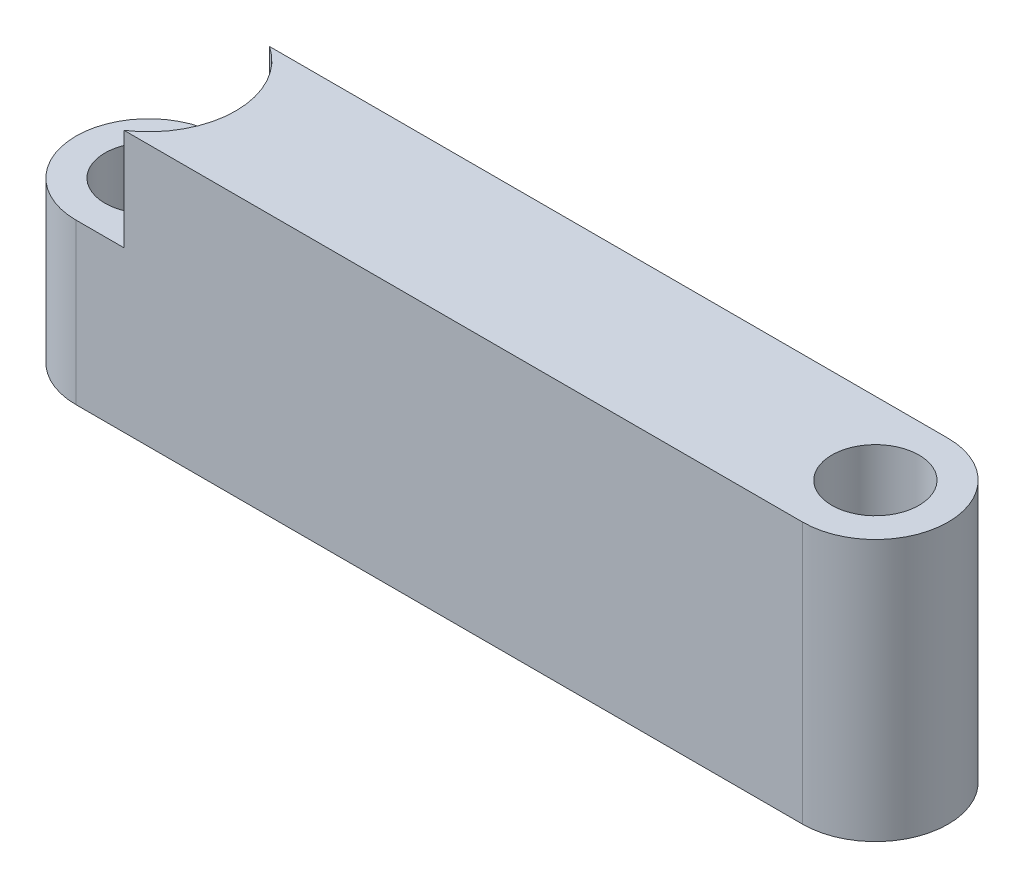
ISO-10303-21;
HEADER;
FILE_DESCRIPTION(('STEP AP214'),'2;1');
FILE_NAME('part.step','',(''),(''),'','','');
FILE_SCHEMA(('AUTOMOTIVE_DESIGN { 1 0 10303 214 1 1 1 1 }'));
ENDSEC;
DATA;
#1=APPLICATION_CONTEXT('core data for automotive mechanical design processes');
#2=APPLICATION_PROTOCOL_DEFINITION('international standard','automotive_design',2000,#1);
#3=PRODUCT_CONTEXT('',#1,'mechanical');
#4=PRODUCT('Part','Part','',(#3));
#5=PRODUCT_RELATED_PRODUCT_CATEGORY('part','',(#4));
#6=PRODUCT_DEFINITION_FORMATION('','',#4);
#7=PRODUCT_DEFINITION_CONTEXT('part definition',#1,'design');
#8=PRODUCT_DEFINITION('design','',#6,#7);
#9=PRODUCT_DEFINITION_SHAPE('','',#8);
#10=(LENGTH_UNIT() NAMED_UNIT(*) SI_UNIT(.MILLI.,.METRE.));
#11=(NAMED_UNIT(*) PLANE_ANGLE_UNIT() SI_UNIT($,.RADIAN.));
#12=(NAMED_UNIT(*) SI_UNIT($,.STERADIAN.) SOLID_ANGLE_UNIT());
#13=UNCERTAINTY_MEASURE_WITH_UNIT(LENGTH_MEASURE(1.E-05),#10,'distance_accuracy_value','');
#14=(GEOMETRIC_REPRESENTATION_CONTEXT(3) GLOBAL_UNCERTAINTY_ASSIGNED_CONTEXT((#13)) GLOBAL_UNIT_ASSIGNED_CONTEXT((#10,
#11,#12)) REPRESENTATION_CONTEXT('',''));
#15=CARTESIAN_POINT('',(0.,0.,0.));
#16=DIRECTION('',(0.,0.,1.));
#17=DIRECTION('',(1.,0.,0.));
#18=AXIS2_PLACEMENT_3D('',#15,#16,#17);
#19=CARTESIAN_POINT('',(-10.9827898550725,9.,0.));
#20=DIRECTION('',(0.,-1.,0.));
#21=DIRECTION('',(0.,0.,-1.));
#22=AXIS2_PLACEMENT_3D('',#19,#20,#21);
#23=CYLINDRICAL_SURFACE('',#22,2.5);
#24=CARTESIAN_POINT('',(-10.9827898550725,5.5,0.));
#25=DIRECTION('',(0.,1.,0.));
#26=DIRECTION('',(0.,0.,1.));
#27=AXIS2_PLACEMENT_3D('',#24,#25,#26);
#28=CIRCLE('',#27,2.5);
#29=CARTESIAN_POINT('',(-10.9827898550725,5.5,-2.5));
#30=VERTEX_POINT('',#29);
#31=CARTESIAN_POINT('',(-10.9827898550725,5.5,2.5));
#32=VERTEX_POINT('',#31);
#33=EDGE_CURVE('E85',#30,#32,#28,.T.);
#34=ORIENTED_EDGE('',*,*,#33,.F.);
#35=DIRECTION('',(0.,-1.,0.));
#36=VECTOR('',#35,1.);
#37=CARTESIAN_POINT('',(-10.9827898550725,9.,-2.5));
#38=LINE('',#37,#36);
#39=CARTESIAN_POINT('',(-10.9827898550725,0.,-2.5));
#40=VERTEX_POINT('',#39);
#41=EDGE_CURVE('E79',#30,#40,#38,.T.);
#42=ORIENTED_EDGE('',*,*,#41,.T.);
#43=CARTESIAN_POINT('',(-10.9827898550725,0.,0.));
#44=DIRECTION('',(0.,1.,0.));
#45=DIRECTION('',(0.,0.,1.));
#46=AXIS2_PLACEMENT_3D('',#43,#44,#45);
#47=CIRCLE('',#46,2.5);
#48=CARTESIAN_POINT('',(-10.9827898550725,0.,2.5));
#49=VERTEX_POINT('',#48);
#50=EDGE_CURVE('E82',#40,#49,#47,.T.);
#51=ORIENTED_EDGE('',*,*,#50,.T.);
#52=DIRECTION('',(0.,-1.,0.));
#53=VECTOR('',#52,1.);
#54=CARTESIAN_POINT('',(-10.9827898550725,9.,2.5));
#55=LINE('',#54,#53);
#56=EDGE_CURVE('E11',#32,#49,#55,.T.);
#57=ORIENTED_EDGE('',*,*,#56,.F.);
#58=EDGE_LOOP('',(#34,#42,#51,#57));
#59=FACE_BOUND('',#58,.T.);
#60=ADVANCED_FACE('F35',(#59),#23,.T.);
#61=CARTESIAN_POINT('',(-10.9827898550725,9.,0.));
#62=DIRECTION('',(0.,-1.,0.));
#63=DIRECTION('',(0.,0.,-1.));
#64=AXIS2_PLACEMENT_3D('',#61,#62,#63);
#65=CYLINDRICAL_SURFACE('',#64,1.5);
#66=CARTESIAN_POINT('',(-10.9827898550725,0.,0.));
#67=DIRECTION('',(0.,1.,0.));
#68=DIRECTION('',(0.,0.,1.));
#69=AXIS2_PLACEMENT_3D('',#66,#67,#68);
#70=CIRCLE('',#69,1.5);
#71=CARTESIAN_POINT('',(-10.9827898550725,0.,1.5));
#72=VERTEX_POINT('',#71);
#73=EDGE_CURVE('E99',#72,#72,#70,.T.);
#74=ORIENTED_EDGE('',*,*,#73,.F.);
#75=EDGE_LOOP('',(#74));
#76=FACE_BOUND('',#75,.T.);
#77=CARTESIAN_POINT('',(-10.9827898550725,5.5,0.));
#78=DIRECTION('',(0.,1.,0.));
#79=DIRECTION('',(0.,0.,1.));
#80=AXIS2_PLACEMENT_3D('',#77,#78,#79);
#81=CIRCLE('',#80,1.5);
#82=CARTESIAN_POINT('',(-10.9827898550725,5.5,1.5));
#83=VERTEX_POINT('',#82);
#84=EDGE_CURVE('E39',#83,#83,#81,.T.);
#85=ORIENTED_EDGE('',*,*,#84,.T.);
#86=EDGE_LOOP('',(#85));
#87=FACE_BOUND('',#86,.T.);
#88=ADVANCED_FACE('F37',(#76,#87),#65,.F.);
#89=CARTESIAN_POINT('',(0.,9.,2.5));
#90=DIRECTION('',(0.,0.,-1.));
#91=DIRECTION('',(-1.,0.,0.));
#92=AXIS2_PLACEMENT_3D('',#89,#90,#91);
#93=PLANE('',#92);
#94=DIRECTION('',(1.,0.,0.));
#95=VECTOR('',#94,1.);
#96=CARTESIAN_POINT('',(0.,9.,2.5));
#97=LINE('',#96,#95);
#98=CARTESIAN_POINT('',(-9.32447745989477,9.,2.5));
#99=VERTEX_POINT('',#98);
#100=CARTESIAN_POINT('',(14.0172101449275,9.,2.5));
#101=VERTEX_POINT('',#100);
#102=EDGE_CURVE('E108',#99,#101,#97,.T.);
#103=ORIENTED_EDGE('',*,*,#102,.F.);
#104=DIRECTION('',(0.,1.,0.));
#105=VECTOR('',#104,1.);
#106=CARTESIAN_POINT('',(-9.32447745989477,5.5,2.5));
#107=LINE('',#106,#105);
#108=CARTESIAN_POINT('',(-9.32447745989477,5.5,2.5));
#109=VERTEX_POINT('',#108);
#110=EDGE_CURVE('E51',#99,#109,#107,.F.);
#111=ORIENTED_EDGE('',*,*,#110,.T.);
#112=DIRECTION('',(1.,0.,0.));
#113=VECTOR('',#112,1.);
#114=CARTESIAN_POINT('',(0.,5.5,2.5));
#115=LINE('',#114,#113);
#116=EDGE_CURVE('E127',#32,#109,#115,.T.);
#117=ORIENTED_EDGE('',*,*,#116,.F.);
#118=ORIENTED_EDGE('',*,*,#56,.T.);
#119=DIRECTION('',(1.,0.,0.));
#120=VECTOR('',#119,1.);
#121=CARTESIAN_POINT('',(0.,0.,2.5));
#122=LINE('',#121,#120);
#123=CARTESIAN_POINT('',(14.0172101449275,0.,2.5));
#124=VERTEX_POINT('',#123);
#125=EDGE_CURVE('E98',#49,#124,#122,.T.);
#126=ORIENTED_EDGE('',*,*,#125,.T.);
#127=DIRECTION('',(0.,-1.,0.));
#128=VECTOR('',#127,1.);
#129=CARTESIAN_POINT('',(14.0172101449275,9.,2.5));
#130=LINE('',#129,#128);
#131=EDGE_CURVE('E44',#101,#124,#130,.T.);
#132=ORIENTED_EDGE('',*,*,#131,.F.);
#133=EDGE_LOOP('',(#103,#111,#117,#118,#126,#132));
#134=FACE_BOUND('',#133,.T.);
#135=ADVANCED_FACE('F122',(#134),#93,.F.);
#136=CARTESIAN_POINT('',(14.0172101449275,9.,0.));
#137=DIRECTION('',(0.,-1.,0.));
#138=DIRECTION('',(0.,0.,-1.));
#139=AXIS2_PLACEMENT_3D('',#136,#137,#138);
#140=CYLINDRICAL_SURFACE('',#139,2.5);
#141=CARTESIAN_POINT('',(14.0172101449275,0.,0.));
#142=DIRECTION('',(0.,1.,0.));
#143=DIRECTION('',(0.,0.,1.));
#144=AXIS2_PLACEMENT_3D('',#141,#142,#143);
#145=CIRCLE('',#144,2.5);
#146=CARTESIAN_POINT('',(14.0172101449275,0.,-2.5));
#147=VERTEX_POINT('',#146);
#148=EDGE_CURVE('E105',#124,#147,#145,.T.);
#149=ORIENTED_EDGE('',*,*,#148,.T.);
#150=DIRECTION('',(0.,-1.,0.));
#151=VECTOR('',#150,1.);
#152=CARTESIAN_POINT('',(14.0172101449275,9.,-2.5));
#153=LINE('',#152,#151);
#154=CARTESIAN_POINT('',(14.0172101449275,9.,-2.5));
#155=VERTEX_POINT('',#154);
#156=EDGE_CURVE('E88',#155,#147,#153,.T.);
#157=ORIENTED_EDGE('',*,*,#156,.F.);
#158=CARTESIAN_POINT('',(14.0172101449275,9.,0.));
#159=DIRECTION('',(0.,1.,0.));
#160=DIRECTION('',(0.,0.,1.));
#161=AXIS2_PLACEMENT_3D('',#158,#159,#160);
#162=CIRCLE('',#161,2.5);
#163=EDGE_CURVE('E119',#101,#155,#162,.T.);
#164=ORIENTED_EDGE('',*,*,#163,.F.);
#165=ORIENTED_EDGE('',*,*,#131,.T.);
#166=EDGE_LOOP('',(#149,#157,#164,#165));
#167=FACE_BOUND('',#166,.T.);
#168=ADVANCED_FACE('F118',(#167),#140,.T.);
#169=CARTESIAN_POINT('',(0.,9.,-2.5));
#170=DIRECTION('',(0.,0.,-1.));
#171=DIRECTION('',(-1.,0.,0.));
#172=AXIS2_PLACEMENT_3D('',#169,#170,#171);
#173=PLANE('',#172);
#174=DIRECTION('',(0.,1.,0.));
#175=VECTOR('',#174,1.);
#176=CARTESIAN_POINT('',(-9.32447745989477,5.5,-2.5));
#177=LINE('',#176,#175);
#178=CARTESIAN_POINT('',(-9.32447745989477,9.,-2.5));
#179=VERTEX_POINT('',#178);
#180=CARTESIAN_POINT('',(-9.32447745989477,5.5,-2.5));
#181=VERTEX_POINT('',#180);
#182=EDGE_CURVE('E139',#179,#181,#177,.F.);
#183=ORIENTED_EDGE('',*,*,#182,.F.);
#184=DIRECTION('',(1.,0.,0.));
#185=VECTOR('',#184,1.);
#186=CARTESIAN_POINT('',(0.,9.,-2.5));
#187=LINE('',#186,#185);
#188=EDGE_CURVE('E60',#179,#155,#187,.T.);
#189=ORIENTED_EDGE('',*,*,#188,.T.);
#190=ORIENTED_EDGE('',*,*,#156,.T.);
#191=DIRECTION('',(1.,0.,0.));
#192=VECTOR('',#191,1.);
#193=CARTESIAN_POINT('',(0.,0.,-2.5));
#194=LINE('',#193,#192);
#195=EDGE_CURVE('E97',#40,#147,#194,.T.);
#196=ORIENTED_EDGE('',*,*,#195,.F.);
#197=ORIENTED_EDGE('',*,*,#41,.F.);
#198=DIRECTION('',(1.,0.,0.));
#199=VECTOR('',#198,1.);
#200=CARTESIAN_POINT('',(0.,5.5,-2.5));
#201=LINE('',#200,#199);
#202=EDGE_CURVE('E136',#30,#181,#201,.T.);
#203=ORIENTED_EDGE('',*,*,#202,.T.);
#204=EDGE_LOOP('',(#183,#189,#190,#196,#197,#203));
#205=FACE_BOUND('',#204,.T.);
#206=ADVANCED_FACE('F101',(#205),#173,.T.);
#207=CARTESIAN_POINT('',(14.0172101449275,9.,0.));
#208=DIRECTION('',(0.,-1.,0.));
#209=DIRECTION('',(0.,0.,-1.));
#210=AXIS2_PLACEMENT_3D('',#207,#208,#209);
#211=CYLINDRICAL_SURFACE('',#210,1.5);
#212=CARTESIAN_POINT('',(14.0172101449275,9.,0.));
#213=DIRECTION('',(0.,1.,0.));
#214=DIRECTION('',(0.,0.,1.));
#215=AXIS2_PLACEMENT_3D('',#212,#213,#214);
#216=CIRCLE('',#215,1.5);
#217=CARTESIAN_POINT('',(14.0172101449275,9.,1.5));
#218=VERTEX_POINT('',#217);
#219=EDGE_CURVE('E89',#218,#218,#216,.T.);
#220=ORIENTED_EDGE('',*,*,#219,.T.);
#221=EDGE_LOOP('',(#220));
#222=FACE_BOUND('',#221,.T.);
#223=CARTESIAN_POINT('',(14.0172101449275,0.,0.));
#224=DIRECTION('',(0.,1.,0.));
#225=DIRECTION('',(0.,0.,1.));
#226=AXIS2_PLACEMENT_3D('',#223,#224,#225);
#227=CIRCLE('',#226,1.5);
#228=CARTESIAN_POINT('',(14.0172101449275,0.,1.5));
#229=VERTEX_POINT('',#228);
#230=EDGE_CURVE('E104',#229,#229,#227,.T.);
#231=ORIENTED_EDGE('',*,*,#230,.F.);
#232=EDGE_LOOP('',(#231));
#233=FACE_BOUND('',#232,.T.);
#234=ADVANCED_FACE('F178',(#222,#233),#211,.F.);
#235=CARTESIAN_POINT('',(0.,9.,0.));
#236=DIRECTION('',(0.,1.,0.));
#237=DIRECTION('',(0.,0.,1.));
#238=AXIS2_PLACEMENT_3D('',#235,#236,#237);
#239=PLANE('',#238);
#240=CARTESIAN_POINT('',(-10.9827898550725,9.,0.));
#241=DIRECTION('',(0.,1.,0.));
#242=DIRECTION('',(0.,0.,1.));
#243=AXIS2_PLACEMENT_3D('',#240,#241,#242);
#244=CIRCLE('',#243,3.);
#245=EDGE_CURVE('E143',#99,#179,#244,.T.);
#246=ORIENTED_EDGE('',*,*,#245,.F.);
#247=ORIENTED_EDGE('',*,*,#102,.T.);
#248=ORIENTED_EDGE('',*,*,#163,.T.);
#249=ORIENTED_EDGE('',*,*,#188,.F.);
#250=EDGE_LOOP('',(#246,#247,#248,#249));
#251=FACE_BOUND('',#250,.T.);
#252=ORIENTED_EDGE('',*,*,#219,.F.);
#253=EDGE_LOOP('',(#252));
#254=FACE_BOUND('',#253,.T.);
#255=ADVANCED_FACE('F155',(#251,#254),#239,.T.);
#256=CARTESIAN_POINT('',(0.,0.,0.));
#257=DIRECTION('',(0.,1.,0.));
#258=DIRECTION('',(0.,0.,1.));
#259=AXIS2_PLACEMENT_3D('',#256,#257,#258);
#260=PLANE('',#259);
#261=ORIENTED_EDGE('',*,*,#73,.T.);
#262=EDGE_LOOP('',(#261));
#263=FACE_BOUND('',#262,.T.);
#264=ORIENTED_EDGE('',*,*,#50,.F.);
#265=ORIENTED_EDGE('',*,*,#195,.T.);
#266=ORIENTED_EDGE('',*,*,#148,.F.);
#267=ORIENTED_EDGE('',*,*,#125,.F.);
#268=EDGE_LOOP('',(#264,#265,#266,#267));
#269=FACE_BOUND('',#268,.T.);
#270=ORIENTED_EDGE('',*,*,#230,.T.);
#271=EDGE_LOOP('',(#270));
#272=FACE_BOUND('',#271,.T.);
#273=ADVANCED_FACE('F94',(#263,#269,#272),#260,.F.);
#274=CARTESIAN_POINT('',(-10.9827898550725,5.5,0.));
#275=DIRECTION('',(0.,1.,0.));
#276=DIRECTION('',(0.,0.,1.));
#277=AXIS2_PLACEMENT_3D('',#274,#275,#276);
#278=PLANE('',#277);
#279=ORIENTED_EDGE('',*,*,#84,.F.);
#280=EDGE_LOOP('',(#279));
#281=FACE_BOUND('',#280,.T.);
#282=ORIENTED_EDGE('',*,*,#116,.T.);
#283=CARTESIAN_POINT('',(-10.9827898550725,5.5,0.));
#284=DIRECTION('',(0.,1.,0.));
#285=DIRECTION('',(0.,0.,1.));
#286=AXIS2_PLACEMENT_3D('',#283,#284,#285);
#287=CIRCLE('',#286,3.);
#288=EDGE_CURVE('E142',#109,#181,#287,.T.);
#289=ORIENTED_EDGE('',*,*,#288,.T.);
#290=ORIENTED_EDGE('',*,*,#202,.F.);
#291=ORIENTED_EDGE('',*,*,#33,.T.);
#292=EDGE_LOOP('',(#282,#289,#290,#291));
#293=FACE_BOUND('',#292,.T.);
#294=ADVANCED_FACE('F149',(#281,#293),#278,.T.);
#295=CARTESIAN_POINT('',(-10.9827898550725,5.5,0.));
#296=DIRECTION('',(0.,1.,0.));
#297=DIRECTION('',(0.,0.,1.));
#298=AXIS2_PLACEMENT_3D('',#295,#296,#297);
#299=CYLINDRICAL_SURFACE('',#298,3.);
#300=ORIENTED_EDGE('',*,*,#245,.T.);
#301=ORIENTED_EDGE('',*,*,#182,.T.);
#302=ORIENTED_EDGE('',*,*,#288,.F.);
#303=ORIENTED_EDGE('',*,*,#110,.F.);
#304=EDGE_LOOP('',(#300,#301,#302,#303));
#305=FACE_BOUND('',#304,.T.);
#306=ADVANCED_FACE('F157',(#305),#299,.F.);
#307=CLOSED_SHELL('',(#60,#88,#135,#168,#206,#234,#255,#273,#294,#306));
#308=MANIFOLD_SOLID_BREP('B2',#307);
#309=ADVANCED_BREP_SHAPE_REPRESENTATION('',(#18,#308),#14);
#310=SHAPE_DEFINITION_REPRESENTATION(#9,#309);
ENDSEC;
END-ISO-10303-21;
